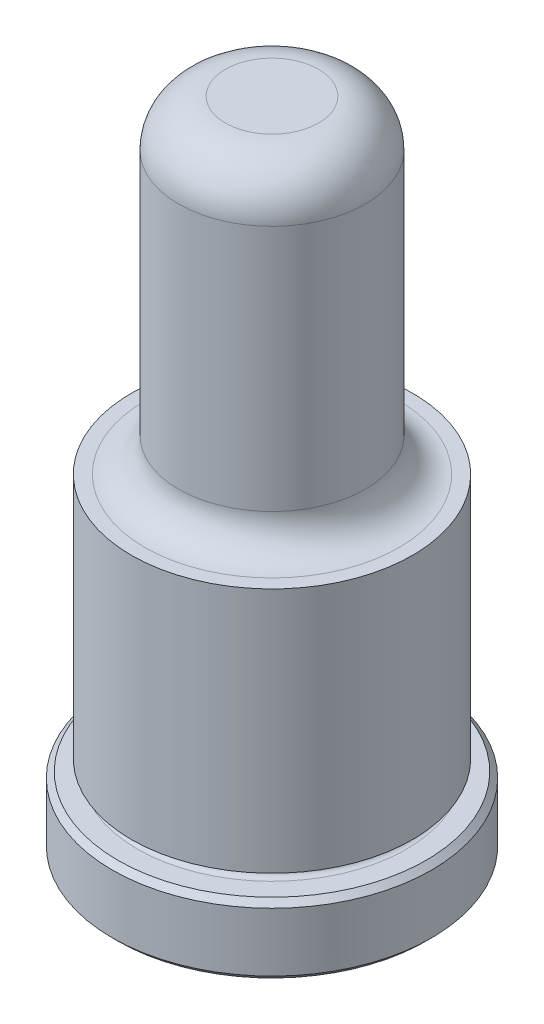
from build123d import *

# Parameters (mm, degrees)
FILLET6_R     = 3.175
CHAMFER1_SIZE = 0.381


with BuildPart() as part:
    # Sketch1 → Revolve1 (revolve)
    with BuildSketch(Plane(origin=(0, 0, 0), x_dir=(0, 0, -1), z_dir=(1, 0, 0)), mode=Mode.PRIVATE) as revolve1_sk:
        with BuildLine():
            Line((0, 0), (10.8331, 0))
            Line((10.8331, 0), (10.8331, 4.7498))
            Line((10.8331, 4.7498), (9.1313, 4.7498))
            ThreePointArc((9.1313, 4.7498), (8.7503, 5.1308), (9.1313, 5.5118))
            Line((9.1313, 5.5118), (9.5377, 5.5118))
            Line((9.5377, 5.5118), (9.5377, 22.225))
            Line((9.5377, 22.225), (8.6233, 22.225))
            ThreePointArc((8.6233, 22.225), (7.006853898, 22.894553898), (6.3373, 24.511))
            Line((6.3373, 24.511), (6.3373, 44.45))
            Line((6.3373, 44.45), (0, 44.45))
            Line((0, 44.45), (0, 0))
        make_face()
    revolve(revolve1_sk.sketch.rotate(Axis((0, 0, 0), (0, -1, 0)), 180), axis=Axis((0, 0, 0), (0, -1, 0)))

    # Fillet6
    fillet6_edges = [part.edges().sort_by_distance(p)[0] for p in [
        (0, 44.45, -6.3373),
    ]]
    fillet(fillet6_edges, radius=FILLET6_R)

    # Chamfer1
    chamfer1_edges = [part.edges().sort_by_distance(p)[0] for p in [
        (0, 4.7498, -10.8331),
        (0, 0, -10.8331),
    ]]
    chamfer(chamfer1_edges, length=CHAMFER1_SIZE)


solid = part.part
